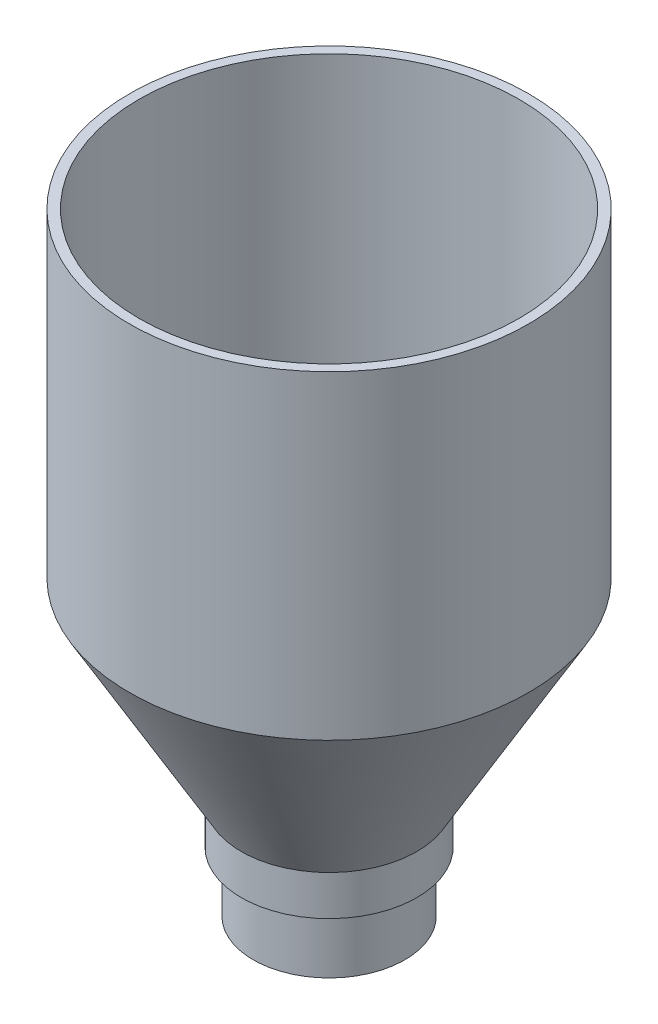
from build123d import *


with BuildPart() as part:
    # Esquisse2 → R_volution1 (revolve)
    with BuildSketch(Plane.XY, mode=Mode.PRIVATE) as r_volution1_sk:
        with BuildLine():
            Line((-11, 7.5), (-11, 12.5))
            Line((-11, 12.5), (-25, 36.748711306))
            Line((-25, 36.748711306), (-25, 76.748711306))
            Line((-25, 76.748711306), (-23.8, 76.748711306))
            Line((-23.8, 76.748711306), (-23.8, 37.070250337))
            Line((-23.8, 37.070250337), (-9.101923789, 11.612435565))
            ThreePointArc((-9.101923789, 11.612435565), (-8.280255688, 9.628753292), (-8, 7.5))
            Line((-8, 7.5), (-8, 0))
            Line((-8, 0), (-9.5, 0))
            Line((-9.5, 0), (-9.5, 7.5))
            Line((-9.5, 7.5), (-11, 7.5))
        make_face()
    revolve(r_volution1_sk.sketch.rotate(Axis((0, -4.536011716, 0), (0, 1, 0)), 270), axis=Axis((0, -4.536011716, 0), (0, 1, 0)))


solid = part.part
